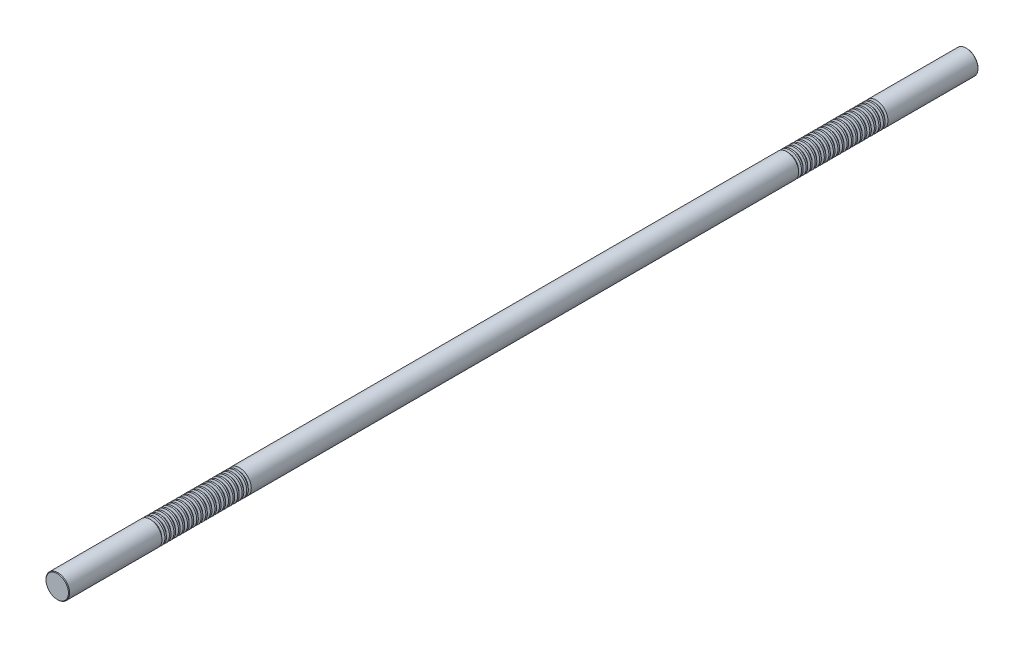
from build123d import *

# Parameters (mm, degrees)
SKETCH1_R           = 13
BOSS_EXTRUDE1_DEPTH = 500
CHAMFER1_SIZE       = 0.65
LPATTERN1_COUNT     = 20
LPATTERN1_PITCH     = 5
LPATTERN2_COUNT     = 2
LPATTERN2_PITCH     = 700


with BuildPart() as part:
    # Sketch1 → Boss-Extrude1 (new, symmetric)
    with BuildSketch(Plane.XY):
        Circle(SKETCH1_R)
    extrude(amount=BOSS_EXTRUDE1_DEPTH, both=True)

    # Chamfer1
    chamfer1_edges = [part.edges().sort_by_distance(p)[0] for p in [
        (-13, 0, -500),
        (-13, 0, 500),
    ]]
    chamfer(chamfer1_edges, length=CHAMFER1_SIZE)

    # Sketch2 → Cut-Revolve1 (revolve, cut)
    with BuildSketch(Plane(origin=(0, 0, 0), x_dir=(0, 0, -1), z_dir=(1, 0, 0)), mode=Mode.PRIVATE) as cut_revolve1_sk:
        Polygon((400.36843014, 13), (397.13156986, 13), (397.86843014, 10.25), (399.63156986, 10.25), align=None)
    cut_revolve1 = revolve(cut_revolve1_sk.sketch.rotate(Axis((0, 0, 500), (0, 0, -1)), 90), axis=Axis((0, 0, 500), (0, 0, -1)), mode=Mode.SUBTRACT)

    # LPattern1: Cut-Revolve1 ×20
    with Locations(*[(0, 0, i * LPATTERN1_PITCH) for i in range(1, LPATTERN1_COUNT)]):
        add(cut_revolve1, mode=Mode.SUBTRACT)

    # LPattern2: Cut-Revolve1 ×2
    with Locations(*[(0, 0, i * LPATTERN2_PITCH) for i in range(1, LPATTERN2_COUNT)]):
        add(cut_revolve1, mode=Mode.SUBTRACT)

    # LPattern2 copy 1 sketch → LPattern2 copy 1 (revolve, cut)
    with BuildSketch(Plane(origin=(0, 0, 705), x_dir=(0, 0, -1), z_dir=(1, 0, 0))):
        Polygon((400.36843014, 13), (397.13156986, 13), (397.86843014, 10.25), (399.63156986, 10.25), align=None)
    revolve(axis=Axis((0, 0, 1205), (0, 0, -1)), mode=Mode.SUBTRACT)

    # LPattern2 copy 2 sketch → LPattern2 copy 2 (revolve, cut)
    with BuildSketch(Plane(origin=(0, 0, 710), x_dir=(0, 0, -1), z_dir=(1, 0, 0))):
        Polygon((400.36843014, 13), (397.13156986, 13), (397.86843014, 10.25), (399.63156986, 10.25), align=None)
    revolve(axis=Axis((0, 0, 1210), (0, 0, -1)), mode=Mode.SUBTRACT)

    # LPattern2 copy 3 sketch → LPattern2 copy 3 (revolve, cut)
    with BuildSketch(Plane(origin=(0, 0, 715), x_dir=(0, 0, -1), z_dir=(1, 0, 0))):
        Polygon((400.36843014, 13), (397.13156986, 13), (397.86843014, 10.25), (399.63156986, 10.25), align=None)
    revolve(axis=Axis((0, 0, 1215), (0, 0, -1)), mode=Mode.SUBTRACT)

    # LPattern2 copy 4 sketch → LPattern2 copy 4 (revolve, cut)
    with BuildSketch(Plane(origin=(0, 0, 720), x_dir=(0, 0, -1), z_dir=(1, 0, 0))):
        Polygon((400.36843014, 13), (397.13156986, 13), (397.86843014, 10.25), (399.63156986, 10.25), align=None)
    revolve(axis=Axis((0, 0, 1220), (0, 0, -1)), mode=Mode.SUBTRACT)

    # LPattern2 copy 5 sketch → LPattern2 copy 5 (revolve, cut)
    with BuildSketch(Plane(origin=(0, 0, 725), x_dir=(0, 0, -1), z_dir=(1, 0, 0))):
        Polygon((400.36843014, 13), (397.13156986, 13), (397.86843014, 10.25), (399.63156986, 10.25), align=None)
    revolve(axis=Axis((0, 0, 1225), (0, 0, -1)), mode=Mode.SUBTRACT)

    # LPattern2 copy 6 sketch → LPattern2 copy 6 (revolve, cut)
    with BuildSketch(Plane(origin=(0, 0, 730), x_dir=(0, 0, -1), z_dir=(1, 0, 0))):
        Polygon((400.36843014, 13), (397.13156986, 13), (397.86843014, 10.25), (399.63156986, 10.25), align=None)
    revolve(axis=Axis((0, 0, 1230), (0, 0, -1)), mode=Mode.SUBTRACT)

    # LPattern2 copy 7 sketch → LPattern2 copy 7 (revolve, cut)
    with BuildSketch(Plane(origin=(0, 0, 735), x_dir=(0, 0, -1), z_dir=(1, 0, 0))):
        Polygon((400.36843014, 13), (397.13156986, 13), (397.86843014, 10.25), (399.63156986, 10.25), align=None)
    revolve(axis=Axis((0, 0, 1235), (0, 0, -1)), mode=Mode.SUBTRACT)

    # LPattern2 copy 8 sketch → LPattern2 copy 8 (revolve, cut)
    with BuildSketch(Plane(origin=(0, 0, 740), x_dir=(0, 0, -1), z_dir=(1, 0, 0))):
        Polygon((400.36843014, 13), (397.13156986, 13), (397.86843014, 10.25), (399.63156986, 10.25), align=None)
    revolve(axis=Axis((0, 0, 1240), (0, 0, -1)), mode=Mode.SUBTRACT)

    # LPattern2 copy 9 sketch → LPattern2 copy 9 (revolve, cut)
    with BuildSketch(Plane(origin=(0, 0, 745), x_dir=(0, 0, -1), z_dir=(1, 0, 0))):
        Polygon((400.36843014, 13), (397.13156986, 13), (397.86843014, 10.25), (399.63156986, 10.25), align=None)
    revolve(axis=Axis((0, 0, 1245), (0, 0, -1)), mode=Mode.SUBTRACT)

    # LPattern2 copy 10 sketch → LPattern2 copy 10 (revolve, cut)
    with BuildSketch(Plane(origin=(0, 0, 750), x_dir=(0, 0, -1), z_dir=(1, 0, 0))):
        Polygon((400.36843014, 13), (397.13156986, 13), (397.86843014, 10.25), (399.63156986, 10.25), align=None)
    revolve(axis=Axis((0, 0, 1250), (0, 0, -1)), mode=Mode.SUBTRACT)

    # LPattern2 copy 11 sketch → LPattern2 copy 11 (revolve, cut)
    with BuildSketch(Plane(origin=(0, 0, 755), x_dir=(0, 0, -1), z_dir=(1, 0, 0))):
        Polygon((400.36843014, 13), (397.13156986, 13), (397.86843014, 10.25), (399.63156986, 10.25), align=None)
    revolve(axis=Axis((0, 0, 1255), (0, 0, -1)), mode=Mode.SUBTRACT)

    # LPattern2 copy 12 sketch → LPattern2 copy 12 (revolve, cut)
    with BuildSketch(Plane(origin=(0, 0, 760), x_dir=(0, 0, -1), z_dir=(1, 0, 0))):
        Polygon((400.36843014, 13), (397.13156986, 13), (397.86843014, 10.25), (399.63156986, 10.25), align=None)
    revolve(axis=Axis((0, 0, 1260), (0, 0, -1)), mode=Mode.SUBTRACT)

    # LPattern2 copy 13 sketch → LPattern2 copy 13 (revolve, cut)
    with BuildSketch(Plane(origin=(0, 0, 765), x_dir=(0, 0, -1), z_dir=(1, 0, 0))):
        Polygon((400.36843014, 13), (397.13156986, 13), (397.86843014, 10.25), (399.63156986, 10.25), align=None)
    revolve(axis=Axis((0, 0, 1265), (0, 0, -1)), mode=Mode.SUBTRACT)

    # LPattern2 copy 14 sketch → LPattern2 copy 14 (revolve, cut)
    with BuildSketch(Plane(origin=(0, 0, 770), x_dir=(0, 0, -1), z_dir=(1, 0, 0))):
        Polygon((400.36843014, 13), (397.13156986, 13), (397.86843014, 10.25), (399.63156986, 10.25), align=None)
    revolve(axis=Axis((0, 0, 1270), (0, 0, -1)), mode=Mode.SUBTRACT)

    # LPattern2 copy 15 sketch → LPattern2 copy 15 (revolve, cut)
    with BuildSketch(Plane(origin=(0, 0, 775), x_dir=(0, 0, -1), z_dir=(1, 0, 0))):
        Polygon((400.36843014, 13), (397.13156986, 13), (397.86843014, 10.25), (399.63156986, 10.25), align=None)
    revolve(axis=Axis((0, 0, 1275), (0, 0, -1)), mode=Mode.SUBTRACT)

    # LPattern2 copy 16 sketch → LPattern2 copy 16 (revolve, cut)
    with BuildSketch(Plane(origin=(0, 0, 780), x_dir=(0, 0, -1), z_dir=(1, 0, 0))):
        Polygon((400.36843014, 13), (397.13156986, 13), (397.86843014, 10.25), (399.63156986, 10.25), align=None)
    revolve(axis=Axis((0, 0, 1280), (0, 0, -1)), mode=Mode.SUBTRACT)

    # LPattern2 copy 17 sketch → LPattern2 copy 17 (revolve, cut)
    with BuildSketch(Plane(origin=(0, 0, 785), x_dir=(0, 0, -1), z_dir=(1, 0, 0))):
        Polygon((400.36843014, 13), (397.13156986, 13), (397.86843014, 10.25), (399.63156986, 10.25), align=None)
    revolve(axis=Axis((0, 0, 1285), (0, 0, -1)), mode=Mode.SUBTRACT)

    # LPattern2 copy 18 sketch → LPattern2 copy 18 (revolve, cut)
    with BuildSketch(Plane(origin=(0, 0, 790), x_dir=(0, 0, -1), z_dir=(1, 0, 0))):
        Polygon((400.36843014, 13), (397.13156986, 13), (397.86843014, 10.25), (399.63156986, 10.25), align=None)
    revolve(axis=Axis((0, 0, 1290), (0, 0, -1)), mode=Mode.SUBTRACT)

    # LPattern2 copy 19 sketch → LPattern2 copy 19 (revolve, cut)
    with BuildSketch(Plane(origin=(0, 0, 795), x_dir=(0, 0, -1), z_dir=(1, 0, 0))):
        Polygon((400.36843014, 13), (397.13156986, 13), (397.86843014, 10.25), (399.63156986, 10.25), align=None)
    revolve(axis=Axis((0, 0, 1295), (0, 0, -1)), mode=Mode.SUBTRACT)


solid = part.part
